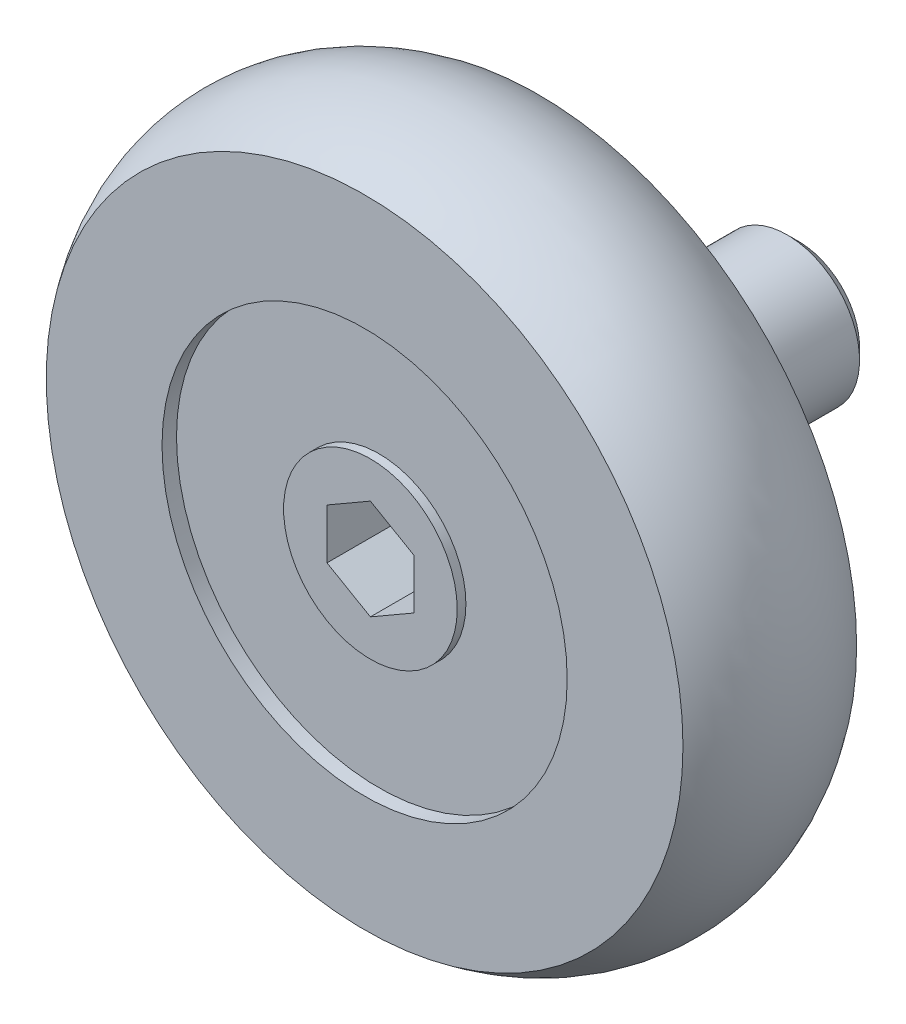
ISO-10303-21;
HEADER;
FILE_DESCRIPTION(('STEP AP214'),'2;1');
FILE_NAME('part.step','',(''),(''),'','','');
FILE_SCHEMA(('AUTOMOTIVE_DESIGN { 1 0 10303 214 1 1 1 1 }'));
ENDSEC;
DATA;
#1=APPLICATION_CONTEXT('core data for automotive mechanical design processes');
#2=APPLICATION_PROTOCOL_DEFINITION('international standard','automotive_design',2000,#1);
#3=PRODUCT_CONTEXT('',#1,'mechanical');
#4=PRODUCT('Part','Part','',(#3));
#5=PRODUCT_RELATED_PRODUCT_CATEGORY('part','',(#4));
#6=PRODUCT_DEFINITION_FORMATION('','',#4);
#7=PRODUCT_DEFINITION_CONTEXT('part definition',#1,'design');
#8=PRODUCT_DEFINITION('design','',#6,#7);
#9=PRODUCT_DEFINITION_SHAPE('','',#8);
#10=(LENGTH_UNIT() NAMED_UNIT(*) SI_UNIT(.MILLI.,.METRE.));
#11=(NAMED_UNIT(*) PLANE_ANGLE_UNIT() SI_UNIT($,.RADIAN.));
#12=(NAMED_UNIT(*) SI_UNIT($,.STERADIAN.) SOLID_ANGLE_UNIT());
#13=UNCERTAINTY_MEASURE_WITH_UNIT(LENGTH_MEASURE(1.E-05),#10,'distance_accuracy_value','');
#14=(GEOMETRIC_REPRESENTATION_CONTEXT(3) GLOBAL_UNCERTAINTY_ASSIGNED_CONTEXT((#13)) GLOBAL_UNIT_ASSIGNED_CONTEXT((#10,
#11,#12)) REPRESENTATION_CONTEXT('',''));
#15=CARTESIAN_POINT('',(0.,0.,0.));
#16=DIRECTION('',(0.,0.,1.));
#17=DIRECTION('',(1.,0.,0.));
#18=AXIS2_PLACEMENT_3D('',#15,#16,#17);
#19=CARTESIAN_POINT('',(0.,4.,0.));
#20=DIRECTION('',(0.,0.,1.));
#21=DIRECTION('',(1.,0.,0.));
#22=AXIS2_PLACEMENT_3D('',#19,#20,#21);
#23=PLANE('',#22);
#24=CARTESIAN_POINT('',(0.,0.,0.));
#25=DIRECTION('',(0.,0.,1.));
#26=DIRECTION('',(1.,0.,0.));
#27=AXIS2_PLACEMENT_3D('',#24,#25,#26);
#28=CIRCLE('',#27,4.);
#29=CARTESIAN_POINT('',(4.,0.,0.));
#30=VERTEX_POINT('',#29);
#31=EDGE_CURVE('E9',#30,#30,#28,.T.);
#32=ORIENTED_EDGE('',*,*,#31,.F.);
#33=EDGE_LOOP('',(#32));
#34=FACE_BOUND('',#33,.T.);
#35=CARTESIAN_POINT('',(0.,0.,0.));
#36=DIRECTION('',(0.,0.,-1.));
#37=DIRECTION('',(-1.,0.,0.));
#38=AXIS2_PLACEMENT_3D('',#35,#36,#37);
#39=CIRCLE('',#38,2.);
#40=CARTESIAN_POINT('',(-2.,0.,0.));
#41=VERTEX_POINT('',#40);
#42=EDGE_CURVE('E104',#41,#41,#39,.T.);
#43=ORIENTED_EDGE('',*,*,#42,.F.);
#44=EDGE_LOOP('',(#43));
#45=FACE_BOUND('',#44,.T.);
#46=ADVANCED_FACE('F14',(#34,#45),#23,.F.);
#47=CARTESIAN_POINT('',(0.,0.,10.));
#48=DIRECTION('',(0.,0.,1.));
#49=DIRECTION('',(1.,0.,0.));
#50=AXIS2_PLACEMENT_3D('',#47,#48,#49);
#51=CYLINDRICAL_SURFACE('',#50,4.);
#52=CARTESIAN_POINT('',(0.,0.,1.5));
#53=DIRECTION('',(0.,0.,1.));
#54=DIRECTION('',(1.,0.,0.));
#55=AXIS2_PLACEMENT_3D('',#52,#53,#54);
#56=CIRCLE('',#55,4.);
#57=CARTESIAN_POINT('',(4.,0.,1.5));
#58=VERTEX_POINT('',#57);
#59=EDGE_CURVE('E22',#58,#58,#56,.T.);
#60=ORIENTED_EDGE('',*,*,#59,.F.);
#61=EDGE_LOOP('',(#60));
#62=FACE_BOUND('',#61,.T.);
#63=ORIENTED_EDGE('',*,*,#31,.T.);
#64=EDGE_LOOP('',(#63));
#65=FACE_BOUND('',#64,.T.);
#66=ADVANCED_FACE('F150',(#62,#65),#51,.T.);
#67=CARTESIAN_POINT('',(0.,4.,1.5));
#68=DIRECTION('',(0.,0.,1.));
#69=DIRECTION('',(1.,0.,0.));
#70=AXIS2_PLACEMENT_3D('',#67,#68,#69);
#71=PLANE('',#70);
#72=CARTESIAN_POINT('',(0.,0.,1.5));
#73=DIRECTION('',(0.,0.,1.));
#74=DIRECTION('',(1.,0.,0.));
#75=AXIS2_PLACEMENT_3D('',#72,#73,#74);
#76=CIRCLE('',#75,7.);
#77=CARTESIAN_POINT('',(7.,0.,1.5));
#78=VERTEX_POINT('',#77);
#79=EDGE_CURVE('E143',#78,#78,#76,.T.);
#80=ORIENTED_EDGE('',*,*,#79,.F.);
#81=EDGE_LOOP('',(#80));
#82=FACE_BOUND('',#81,.T.);
#83=ORIENTED_EDGE('',*,*,#59,.T.);
#84=EDGE_LOOP('',(#83));
#85=FACE_BOUND('',#84,.T.);
#86=ADVANCED_FACE('F148',(#82,#85),#71,.F.);
#87=CARTESIAN_POINT('',(0.,0.,10.));
#88=DIRECTION('',(0.,0.,1.));
#89=DIRECTION('',(1.,0.,0.));
#90=AXIS2_PLACEMENT_3D('',#87,#88,#89);
#91=CYLINDRICAL_SURFACE('',#90,7.);
#92=CARTESIAN_POINT('',(0.,0.,1.00000000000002));
#93=DIRECTION('',(0.,0.,1.));
#94=DIRECTION('',(1.,0.,0.));
#95=AXIS2_PLACEMENT_3D('',#92,#93,#94);
#96=CIRCLE('',#95,7.);
#97=CARTESIAN_POINT('',(7.,0.,1.00000000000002));
#98=VERTEX_POINT('',#97);
#99=EDGE_CURVE('E140',#98,#98,#96,.T.);
#100=ORIENTED_EDGE('',*,*,#99,.F.);
#101=EDGE_LOOP('',(#100));
#102=FACE_BOUND('',#101,.T.);
#103=ORIENTED_EDGE('',*,*,#79,.T.);
#104=EDGE_LOOP('',(#103));
#105=FACE_BOUND('',#104,.T.);
#106=ADVANCED_FACE('F223',(#102,#105),#91,.F.);
#107=CARTESIAN_POINT('',(0.,11.,1.00000000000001));
#108=DIRECTION('',(0.,0.,1.));
#109=DIRECTION('',(1.,0.,0.));
#110=AXIS2_PLACEMENT_3D('',#107,#108,#109);
#111=PLANE('',#110);
#112=CARTESIAN_POINT('',(0.,0.,1.));
#113=DIRECTION('',(0.,0.,1.));
#114=DIRECTION('',(1.,0.,0.));
#115=AXIS2_PLACEMENT_3D('',#112,#113,#114);
#116=CIRCLE('',#115,11.);
#117=CARTESIAN_POINT('',(11.,0.,1.));
#118=VERTEX_POINT('',#117);
#119=EDGE_CURVE('E137',#118,#118,#116,.T.);
#120=ORIENTED_EDGE('',*,*,#119,.F.);
#121=EDGE_LOOP('',(#120));
#122=FACE_BOUND('',#121,.T.);
#123=ORIENTED_EDGE('',*,*,#99,.T.);
#124=EDGE_LOOP('',(#123));
#125=FACE_BOUND('',#124,.T.);
#126=ADVANCED_FACE('F219',(#122,#125),#111,.F.);
#127=CARTESIAN_POINT('',(0.,0.,4.));
#128=DIRECTION('',(0.,0.,1.));
#129=DIRECTION('',(1.,0.,0.));
#130=AXIS2_PLACEMENT_3D('',#127,#128,#129);
#131=TOROIDAL_SURFACE('',#130,7.,5.);
#132=CARTESIAN_POINT('',(0.,0.,7.));
#133=DIRECTION('',(0.,0.,1.));
#134=DIRECTION('',(1.,0.,0.));
#135=AXIS2_PLACEMENT_3D('',#132,#133,#134);
#136=CIRCLE('',#135,11.);
#137=CARTESIAN_POINT('',(11.,0.,7.));
#138=VERTEX_POINT('',#137);
#139=EDGE_CURVE('E134',#138,#138,#136,.T.);
#140=ORIENTED_EDGE('',*,*,#139,.F.);
#141=EDGE_LOOP('',(#140));
#142=FACE_BOUND('',#141,.T.);
#143=ORIENTED_EDGE('',*,*,#119,.T.);
#144=EDGE_LOOP('',(#143));
#145=FACE_BOUND('',#144,.T.);
#146=ADVANCED_FACE('F215',(#142,#145),#131,.T.);
#147=CARTESIAN_POINT('',(0.,11.,7.));
#148=DIRECTION('',(0.,0.,-1.));
#149=DIRECTION('',(-1.,0.,0.));
#150=AXIS2_PLACEMENT_3D('',#147,#148,#149);
#151=PLANE('',#150);
#152=CARTESIAN_POINT('',(0.,0.,7.));
#153=DIRECTION('',(0.,0.,1.));
#154=DIRECTION('',(1.,0.,0.));
#155=AXIS2_PLACEMENT_3D('',#152,#153,#154);
#156=CIRCLE('',#155,7.);
#157=CARTESIAN_POINT('',(7.,0.,7.));
#158=VERTEX_POINT('',#157);
#159=EDGE_CURVE('E131',#158,#158,#156,.T.);
#160=ORIENTED_EDGE('',*,*,#159,.F.);
#161=EDGE_LOOP('',(#160));
#162=FACE_BOUND('',#161,.T.);
#163=ORIENTED_EDGE('',*,*,#139,.T.);
#164=EDGE_LOOP('',(#163));
#165=FACE_BOUND('',#164,.T.);
#166=ADVANCED_FACE('F211',(#162,#165),#151,.F.);
#167=CARTESIAN_POINT('',(0.,0.,10.));
#168=DIRECTION('',(0.,0.,1.));
#169=DIRECTION('',(1.,0.,0.));
#170=AXIS2_PLACEMENT_3D('',#167,#168,#169);
#171=CYLINDRICAL_SURFACE('',#170,7.);
#172=CARTESIAN_POINT('',(0.,0.,6.5));
#173=DIRECTION('',(0.,0.,1.));
#174=DIRECTION('',(1.,0.,0.));
#175=AXIS2_PLACEMENT_3D('',#172,#173,#174);
#176=CIRCLE('',#175,7.);
#177=CARTESIAN_POINT('',(7.,0.,6.5));
#178=VERTEX_POINT('',#177);
#179=EDGE_CURVE('E128',#178,#178,#176,.T.);
#180=ORIENTED_EDGE('',*,*,#179,.F.);
#181=EDGE_LOOP('',(#180));
#182=FACE_BOUND('',#181,.T.);
#183=ORIENTED_EDGE('',*,*,#159,.T.);
#184=EDGE_LOOP('',(#183));
#185=FACE_BOUND('',#184,.T.);
#186=ADVANCED_FACE('F207',(#182,#185),#171,.F.);
#187=CARTESIAN_POINT('',(0.,3.,6.5));
#188=DIRECTION('',(0.,0.,-1.));
#189=DIRECTION('',(-1.,0.,0.));
#190=AXIS2_PLACEMENT_3D('',#187,#188,#189);
#191=PLANE('',#190);
#192=CARTESIAN_POINT('',(0.,0.,6.5));
#193=DIRECTION('',(0.,0.,1.));
#194=DIRECTION('',(1.,0.,0.));
#195=AXIS2_PLACEMENT_3D('',#192,#193,#194);
#196=CIRCLE('',#195,3.);
#197=CARTESIAN_POINT('',(3.,0.,6.5));
#198=VERTEX_POINT('',#197);
#199=EDGE_CURVE('E125',#198,#198,#196,.T.);
#200=ORIENTED_EDGE('',*,*,#199,.F.);
#201=EDGE_LOOP('',(#200));
#202=FACE_BOUND('',#201,.T.);
#203=ORIENTED_EDGE('',*,*,#179,.T.);
#204=EDGE_LOOP('',(#203));
#205=FACE_BOUND('',#204,.T.);
#206=ADVANCED_FACE('F203',(#202,#205),#191,.F.);
#207=CARTESIAN_POINT('',(0.,0.,10.));
#208=DIRECTION('',(0.,0.,1.));
#209=DIRECTION('',(1.,0.,0.));
#210=AXIS2_PLACEMENT_3D('',#207,#208,#209);
#211=CYLINDRICAL_SURFACE('',#210,3.);
#212=CARTESIAN_POINT('',(0.,0.,6.8));
#213=DIRECTION('',(0.,0.,1.));
#214=DIRECTION('',(1.,0.,0.));
#215=AXIS2_PLACEMENT_3D('',#212,#213,#214);
#216=CIRCLE('',#215,3.);
#217=CARTESIAN_POINT('',(3.,0.,6.8));
#218=VERTEX_POINT('',#217);
#219=EDGE_CURVE('E117',#218,#218,#216,.T.);
#220=ORIENTED_EDGE('',*,*,#219,.F.);
#221=EDGE_LOOP('',(#220));
#222=FACE_BOUND('',#221,.T.);
#223=ORIENTED_EDGE('',*,*,#199,.T.);
#224=EDGE_LOOP('',(#223));
#225=FACE_BOUND('',#224,.T.);
#226=ADVANCED_FACE('F200',(#222,#225),#211,.T.);
#227=CARTESIAN_POINT('',(0.,3.,6.8));
#228=DIRECTION('',(0.,0.,-1.));
#229=DIRECTION('',(-1.,0.,0.));
#230=AXIS2_PLACEMENT_3D('',#227,#228,#229);
#231=PLANE('',#230);
#232=DIRECTION('',(-0.866025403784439,-0.5,0.));
#233=VECTOR('',#232,1.);
#234=CARTESIAN_POINT('',(0.,1.73205080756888,6.8));
#235=LINE('',#234,#233);
#236=CARTESIAN_POINT('',(0.,1.73205080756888,6.8));
#237=VERTEX_POINT('',#236);
#238=CARTESIAN_POINT('',(-1.5,0.866025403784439,6.8));
#239=VERTEX_POINT('',#238);
#240=EDGE_CURVE('E103',#237,#239,#235,.T.);
#241=ORIENTED_EDGE('',*,*,#240,.F.);
#242=DIRECTION('',(-0.866025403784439,0.5,0.));
#243=VECTOR('',#242,1.);
#244=CARTESIAN_POINT('',(1.5,0.86602540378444,6.8));
#245=LINE('',#244,#243);
#246=CARTESIAN_POINT('',(1.5,0.86602540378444,6.8));
#247=VERTEX_POINT('',#246);
#248=EDGE_CURVE('E29',#247,#237,#245,.T.);
#249=ORIENTED_EDGE('',*,*,#248,.F.);
#250=DIRECTION('',(0.,1.,0.));
#251=VECTOR('',#250,1.);
#252=CARTESIAN_POINT('',(1.5,-0.866025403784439,6.8));
#253=LINE('',#252,#251);
#254=CARTESIAN_POINT('',(1.5,-0.866025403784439,6.8));
#255=VERTEX_POINT('',#254);
#256=EDGE_CURVE('E113',#255,#247,#253,.T.);
#257=ORIENTED_EDGE('',*,*,#256,.F.);
#258=DIRECTION('',(0.866025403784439,0.5,0.));
#259=VECTOR('',#258,1.);
#260=CARTESIAN_POINT('',(0.,-1.73205080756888,6.8));
#261=LINE('',#260,#259);
#262=CARTESIAN_POINT('',(0.,-1.73205080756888,6.8));
#263=VERTEX_POINT('',#262);
#264=EDGE_CURVE('E111',#263,#255,#261,.T.);
#265=ORIENTED_EDGE('',*,*,#264,.F.);
#266=DIRECTION('',(0.866025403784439,-0.5,0.));
#267=VECTOR('',#266,1.);
#268=CARTESIAN_POINT('',(-1.5,-0.866025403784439,6.8));
#269=LINE('',#268,#267);
#270=CARTESIAN_POINT('',(-1.5,-0.866025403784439,6.8));
#271=VERTEX_POINT('',#270);
#272=EDGE_CURVE('E77',#271,#263,#269,.T.);
#273=ORIENTED_EDGE('',*,*,#272,.F.);
#274=DIRECTION('',(0.,-1.,0.));
#275=VECTOR('',#274,1.);
#276=CARTESIAN_POINT('',(-1.5,0.866025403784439,6.8));
#277=LINE('',#276,#275);
#278=EDGE_CURVE('E107',#239,#271,#277,.T.);
#279=ORIENTED_EDGE('',*,*,#278,.F.);
#280=EDGE_LOOP('',(#241,#249,#257,#265,#273,#279));
#281=FACE_BOUND('',#280,.T.);
#282=ORIENTED_EDGE('',*,*,#219,.T.);
#283=EDGE_LOOP('',(#282));
#284=FACE_BOUND('',#283,.T.);
#285=ADVANCED_FACE('F175',(#281,#284),#231,.F.);
#286=CARTESIAN_POINT('',(1.5,0.86602540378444,4.3));
#287=DIRECTION('',(0.5,0.866025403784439,0.));
#288=DIRECTION('',(-0.866025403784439,0.5,0.));
#289=AXIS2_PLACEMENT_3D('',#286,#287,#288);
#290=PLANE('',#289);
#291=ORIENTED_EDGE('',*,*,#248,.T.);
#292=DIRECTION('',(0.,0.,1.));
#293=VECTOR('',#292,1.);
#294=CARTESIAN_POINT('',(0.,1.73205080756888,4.3));
#295=LINE('',#294,#293);
#296=CARTESIAN_POINT('',(0.,1.73205080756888,4.3));
#297=VERTEX_POINT('',#296);
#298=EDGE_CURVE('E59',#297,#237,#295,.T.);
#299=ORIENTED_EDGE('',*,*,#298,.F.);
#300=DIRECTION('',(-0.866025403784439,0.5,0.));
#301=VECTOR('',#300,1.);
#302=CARTESIAN_POINT('',(1.5,0.86602540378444,4.3));
#303=LINE('',#302,#301);
#304=CARTESIAN_POINT('',(1.5,0.86602540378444,4.3));
#305=VERTEX_POINT('',#304);
#306=EDGE_CURVE('E115',#305,#297,#303,.T.);
#307=ORIENTED_EDGE('',*,*,#306,.F.);
#308=DIRECTION('',(0.,0.,1.));
#309=VECTOR('',#308,1.);
#310=CARTESIAN_POINT('',(1.5,0.86602540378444,4.3));
#311=LINE('',#310,#309);
#312=EDGE_CURVE('E37',#305,#247,#311,.T.);
#313=ORIENTED_EDGE('',*,*,#312,.T.);
#314=EDGE_LOOP('',(#291,#299,#307,#313));
#315=FACE_BOUND('',#314,.T.);
#316=ADVANCED_FACE('F180',(#315),#290,.F.);
#317=CARTESIAN_POINT('',(1.5,-0.866025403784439,4.3));
#318=DIRECTION('',(1.,0.,0.));
#319=DIRECTION('',(0.,1.,0.));
#320=AXIS2_PLACEMENT_3D('',#317,#318,#319);
#321=PLANE('',#320);
#322=ORIENTED_EDGE('',*,*,#256,.T.);
#323=ORIENTED_EDGE('',*,*,#312,.F.);
#324=DIRECTION('',(0.,1.,0.));
#325=VECTOR('',#324,1.);
#326=CARTESIAN_POINT('',(1.5,-0.866025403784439,4.3));
#327=LINE('',#326,#325);
#328=CARTESIAN_POINT('',(1.5,-0.866025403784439,4.3));
#329=VERTEX_POINT('',#328);
#330=EDGE_CURVE('E89',#329,#305,#327,.T.);
#331=ORIENTED_EDGE('',*,*,#330,.F.);
#332=DIRECTION('',(0.,0.,1.));
#333=VECTOR('',#332,1.);
#334=CARTESIAN_POINT('',(1.5,-0.866025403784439,4.3));
#335=LINE('',#334,#333);
#336=EDGE_CURVE('E81',#329,#255,#335,.T.);
#337=ORIENTED_EDGE('',*,*,#336,.T.);
#338=EDGE_LOOP('',(#322,#323,#331,#337));
#339=FACE_BOUND('',#338,.T.);
#340=ADVANCED_FACE('F178',(#339),#321,.F.);
#341=CARTESIAN_POINT('',(0.,-1.73205080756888,4.3));
#342=DIRECTION('',(0.5,-0.866025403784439,0.));
#343=DIRECTION('',(0.866025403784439,0.5,0.));
#344=AXIS2_PLACEMENT_3D('',#341,#342,#343);
#345=PLANE('',#344);
#346=ORIENTED_EDGE('',*,*,#264,.T.);
#347=ORIENTED_EDGE('',*,*,#336,.F.);
#348=DIRECTION('',(0.866025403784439,0.5,0.));
#349=VECTOR('',#348,1.);
#350=CARTESIAN_POINT('',(0.,-1.73205080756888,4.3));
#351=LINE('',#350,#349);
#352=CARTESIAN_POINT('',(0.,-1.73205080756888,4.3));
#353=VERTEX_POINT('',#352);
#354=EDGE_CURVE('E85',#353,#329,#351,.T.);
#355=ORIENTED_EDGE('',*,*,#354,.F.);
#356=DIRECTION('',(0.,0.,1.));
#357=VECTOR('',#356,1.);
#358=CARTESIAN_POINT('',(0.,-1.73205080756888,4.3));
#359=LINE('',#358,#357);
#360=EDGE_CURVE('E70',#353,#263,#359,.T.);
#361=ORIENTED_EDGE('',*,*,#360,.T.);
#362=EDGE_LOOP('',(#346,#347,#355,#361));
#363=FACE_BOUND('',#362,.T.);
#364=ADVANCED_FACE('F86',(#363),#345,.F.);
#365=CARTESIAN_POINT('',(-1.5,-0.866025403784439,4.3));
#366=DIRECTION('',(-0.5,-0.866025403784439,0.));
#367=DIRECTION('',(0.866025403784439,-0.5,0.));
#368=AXIS2_PLACEMENT_3D('',#365,#366,#367);
#369=PLANE('',#368);
#370=ORIENTED_EDGE('',*,*,#272,.T.);
#371=ORIENTED_EDGE('',*,*,#360,.F.);
#372=DIRECTION('',(0.866025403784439,-0.5,0.));
#373=VECTOR('',#372,1.);
#374=CARTESIAN_POINT('',(-1.5,-0.866025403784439,4.3));
#375=LINE('',#374,#373);
#376=CARTESIAN_POINT('',(-1.5,-0.866025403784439,4.3));
#377=VERTEX_POINT('',#376);
#378=EDGE_CURVE('E74',#377,#353,#375,.T.);
#379=ORIENTED_EDGE('',*,*,#378,.F.);
#380=DIRECTION('',(0.,0.,1.));
#381=VECTOR('',#380,1.);
#382=CARTESIAN_POINT('',(-1.5,-0.866025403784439,4.3));
#383=LINE('',#382,#381);
#384=EDGE_CURVE('E82',#377,#271,#383,.T.);
#385=ORIENTED_EDGE('',*,*,#384,.T.);
#386=EDGE_LOOP('',(#370,#371,#379,#385));
#387=FACE_BOUND('',#386,.T.);
#388=ADVANCED_FACE('F72',(#387),#369,.F.);
#389=CARTESIAN_POINT('',(-1.5,0.866025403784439,4.3));
#390=DIRECTION('',(-1.,0.,0.));
#391=DIRECTION('',(0.,-1.,0.));
#392=AXIS2_PLACEMENT_3D('',#389,#390,#391);
#393=PLANE('',#392);
#394=ORIENTED_EDGE('',*,*,#278,.T.);
#395=ORIENTED_EDGE('',*,*,#384,.F.);
#396=DIRECTION('',(0.,-1.,0.));
#397=VECTOR('',#396,1.);
#398=CARTESIAN_POINT('',(-1.5,0.866025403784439,4.3));
#399=LINE('',#398,#397);
#400=CARTESIAN_POINT('',(-1.5,0.866025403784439,4.3));
#401=VERTEX_POINT('',#400);
#402=EDGE_CURVE('E95',#401,#377,#399,.T.);
#403=ORIENTED_EDGE('',*,*,#402,.F.);
#404=DIRECTION('',(0.,0.,1.));
#405=VECTOR('',#404,1.);
#406=CARTESIAN_POINT('',(-1.5,0.866025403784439,4.3));
#407=LINE('',#406,#405);
#408=EDGE_CURVE('E120',#401,#239,#407,.T.);
#409=ORIENTED_EDGE('',*,*,#408,.T.);
#410=EDGE_LOOP('',(#394,#395,#403,#409));
#411=FACE_BOUND('',#410,.T.);
#412=ADVANCED_FACE('F173',(#411),#393,.F.);
#413=CARTESIAN_POINT('',(0.,1.73205080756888,4.3));
#414=DIRECTION('',(-0.5,0.866025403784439,0.));
#415=DIRECTION('',(-0.866025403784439,-0.5,0.));
#416=AXIS2_PLACEMENT_3D('',#413,#414,#415);
#417=PLANE('',#416);
#418=ORIENTED_EDGE('',*,*,#240,.T.);
#419=ORIENTED_EDGE('',*,*,#408,.F.);
#420=DIRECTION('',(-0.866025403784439,-0.5,0.));
#421=VECTOR('',#420,1.);
#422=CARTESIAN_POINT('',(0.,1.73205080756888,4.3));
#423=LINE('',#422,#421);
#424=EDGE_CURVE('E97',#297,#401,#423,.T.);
#425=ORIENTED_EDGE('',*,*,#424,.F.);
#426=ORIENTED_EDGE('',*,*,#298,.T.);
#427=EDGE_LOOP('',(#418,#419,#425,#426));
#428=FACE_BOUND('',#427,.T.);
#429=ADVANCED_FACE('F169',(#428),#417,.F.);
#430=CARTESIAN_POINT('',(0.,0.,4.3));
#431=DIRECTION('',(0.,0.,1.));
#432=DIRECTION('',(1.,0.,0.));
#433=AXIS2_PLACEMENT_3D('',#430,#431,#432);
#434=PLANE('',#433);
#435=ORIENTED_EDGE('',*,*,#306,.T.);
#436=ORIENTED_EDGE('',*,*,#424,.T.);
#437=ORIENTED_EDGE('',*,*,#402,.T.);
#438=ORIENTED_EDGE('',*,*,#378,.T.);
#439=ORIENTED_EDGE('',*,*,#354,.T.);
#440=ORIENTED_EDGE('',*,*,#330,.T.);
#441=EDGE_LOOP('',(#435,#436,#437,#438,#439,#440));
#442=FACE_BOUND('',#441,.T.);
#443=ADVANCED_FACE('F92',(#442),#434,.T.);
#444=CARTESIAN_POINT('',(0.,0.,-8.));
#445=DIRECTION('',(0.,0.,-1.));
#446=DIRECTION('',(-1.,0.,0.));
#447=AXIS2_PLACEMENT_3D('',#444,#445,#446);
#448=CYLINDRICAL_SURFACE('',#447,2.);
#449=CARTESIAN_POINT('',(0.,0.,-1.6));
#450=DIRECTION('',(0.,0.,-1.));
#451=DIRECTION('',(-1.,0.,0.));
#452=AXIS2_PLACEMENT_3D('',#449,#450,#451);
#453=CIRCLE('',#452,2.);
#454=CARTESIAN_POINT('',(-2.,0.,-1.6));
#455=VERTEX_POINT('',#454);
#456=EDGE_CURVE('E161',#455,#455,#453,.T.);
#457=ORIENTED_EDGE('',*,*,#456,.F.);
#458=EDGE_LOOP('',(#457));
#459=FACE_BOUND('',#458,.T.);
#460=ORIENTED_EDGE('',*,*,#42,.T.);
#461=EDGE_LOOP('',(#460));
#462=FACE_BOUND('',#461,.T.);
#463=ADVANCED_FACE('F325',(#459,#462),#448,.T.);
#464=CARTESIAN_POINT('',(0.,2.,-1.6));
#465=DIRECTION('',(0.,0.,-1.));
#466=DIRECTION('',(-1.,0.,0.));
#467=AXIS2_PLACEMENT_3D('',#464,#465,#466);
#468=PLANE('',#467);
#469=CARTESIAN_POINT('',(0.,0.,-1.6));
#470=DIRECTION('',(0.,0.,-1.));
#471=DIRECTION('',(-1.,0.,0.));
#472=AXIS2_PLACEMENT_3D('',#469,#470,#471);
#473=CIRCLE('',#472,2.5);
#474=CARTESIAN_POINT('',(-2.5,0.,-1.6));
#475=VERTEX_POINT('',#474);
#476=EDGE_CURVE('E164',#475,#475,#473,.T.);
#477=ORIENTED_EDGE('',*,*,#476,.F.);
#478=EDGE_LOOP('',(#477));
#479=FACE_BOUND('',#478,.T.);
#480=ORIENTED_EDGE('',*,*,#456,.T.);
#481=EDGE_LOOP('',(#480));
#482=FACE_BOUND('',#481,.T.);
#483=ADVANCED_FACE('F334',(#479,#482),#468,.F.);
#484=CARTESIAN_POINT('',(0.,0.,-8.));
#485=DIRECTION('',(0.,0.,-1.));
#486=DIRECTION('',(-1.,0.,0.));
#487=AXIS2_PLACEMENT_3D('',#484,#485,#486);
#488=CYLINDRICAL_SURFACE('',#487,2.5);
#489=CARTESIAN_POINT('',(0.,0.,-7.6));
#490=DIRECTION('',(0.,0.,-1.));
#491=DIRECTION('',(-1.,0.,0.));
#492=AXIS2_PLACEMENT_3D('',#489,#490,#491);
#493=CIRCLE('',#492,2.5);
#494=CARTESIAN_POINT('',(-2.5,0.,-7.6));
#495=VERTEX_POINT('',#494);
#496=EDGE_CURVE('E378',#495,#495,#493,.T.);
#497=ORIENTED_EDGE('',*,*,#496,.F.);
#498=EDGE_LOOP('',(#497));
#499=FACE_BOUND('',#498,.T.);
#500=ORIENTED_EDGE('',*,*,#476,.T.);
#501=EDGE_LOOP('',(#500));
#502=FACE_BOUND('',#501,.T.);
#503=ADVANCED_FACE('F343',(#499,#502),#488,.T.);
#504=CARTESIAN_POINT('',(0.,0.,-7.6));
#505=DIRECTION('',(0.,0.,1.));
#506=DIRECTION('',(1.,0.,0.));
#507=AXIS2_PLACEMENT_3D('',#504,#505,#506);
#508=CONICAL_SURFACE('',#507,2.5,0.785398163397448);
#509=CARTESIAN_POINT('',(0.,0.,-8.));
#510=DIRECTION('',(0.,0.,-1.));
#511=DIRECTION('',(-1.,0.,0.));
#512=AXIS2_PLACEMENT_3D('',#509,#510,#511);
#513=CIRCLE('',#512,2.1);
#514=CARTESIAN_POINT('',(-2.1,0.,-8.));
#515=VERTEX_POINT('',#514);
#516=EDGE_CURVE('E377',#515,#515,#513,.T.);
#517=ORIENTED_EDGE('',*,*,#516,.F.);
#518=EDGE_LOOP('',(#517));
#519=FACE_BOUND('',#518,.T.);
#520=ORIENTED_EDGE('',*,*,#496,.T.);
#521=EDGE_LOOP('',(#520));
#522=FACE_BOUND('',#521,.T.);
#523=ADVANCED_FACE('F353',(#519,#522),#508,.T.);
#524=CARTESIAN_POINT('',(0.,0.,-8.));
#525=DIRECTION('',(0.,0.,1.));
#526=DIRECTION('',(1.,0.,0.));
#527=AXIS2_PLACEMENT_3D('',#524,#525,#526);
#528=PLANE('',#527);
#529=ORIENTED_EDGE('',*,*,#516,.T.);
#530=EDGE_LOOP('',(#529));
#531=FACE_BOUND('',#530,.T.);
#532=ADVANCED_FACE('F16',(#531),#528,.F.);
#533=CLOSED_SHELL('',(#46,#66,#86,#106,#126,#146,#166,#186,#206,#226,#285,#316,#340,#364,#388,
#412,#429,#443,#463,#483,#503,#523,#532));
#534=MANIFOLD_SOLID_BREP('B1',#533);
#535=ADVANCED_BREP_SHAPE_REPRESENTATION('',(#18,#534),#14);
#536=SHAPE_DEFINITION_REPRESENTATION(#9,#535);
ENDSEC;
END-ISO-10303-21;
